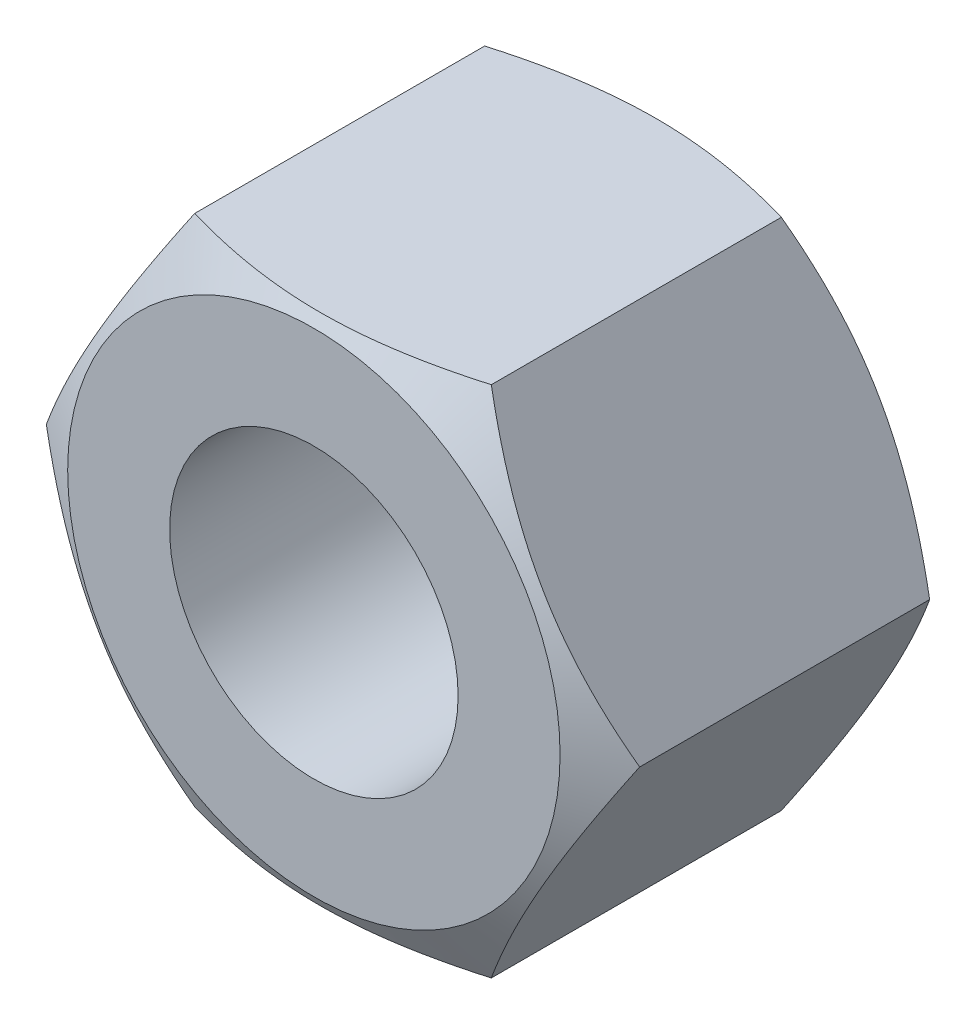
from build123d import *

# Parameters (mm, degrees)
SKETCH1_R     = 5.053
BASENUT_DEPTH = 12.2


with BuildPart() as part:
    # Sketch1 → BaseNut (new body)
    with BuildSketch(Plane.XY):
        Polygon((5.196152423, -9), (10.392304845, 0), (5.196152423, 9), (-5.196152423, 9), (-10.392304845, 0), (-5.196152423, -9), align=None)
        Circle(SKETCH1_R, mode=Mode.SUBTRACT)
    extrude(amount=-BASENUT_DEPTH)

    # Sketch2 → Double-Chamfer (revolve, cut)
    with BuildSketch(Plane(origin=(0, 0, 0), x_dir=(1, 0, 0), z_dir=(0, 1, 0))):
        Polygon((-10.392304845, 12.2), (-8.625, 12.2), (-10.392304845, 11.179646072), align=None)
        Polygon((-10.392304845, 1.020353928), (-10.392304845, 0), (-8.625, 0), align=None)
    revolve(axis=Axis((0, 0, -3.375940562), (0, 0, 1)), mode=Mode.SUBTRACT)


solid = part.part
